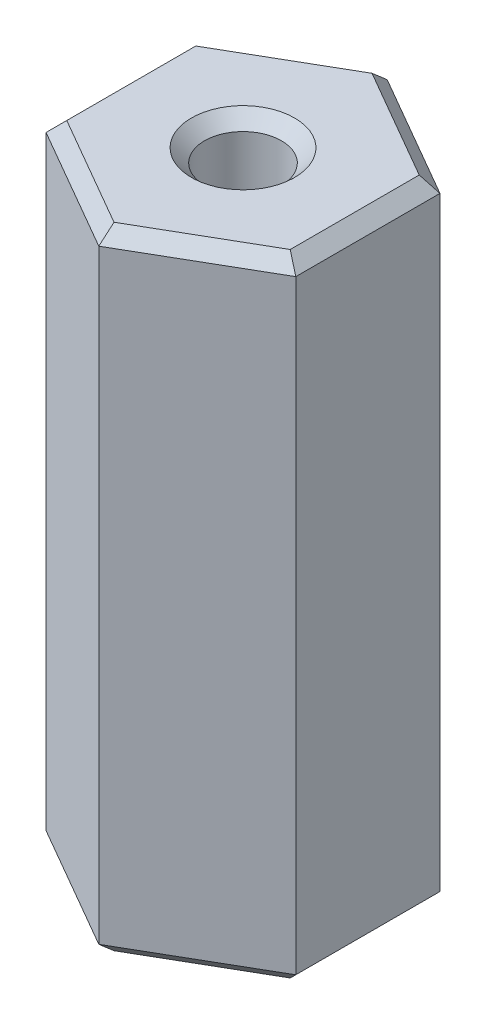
from build123d import *

# Parameters (mm, degrees)
ENL_V_MAT_EXTRU_1_DEPTH      = 52.362547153
ENL_V_MAT_EXTRU_1_DEPTH_BACK = 52.362547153
ESQUISSE2_OUTSIDE_W          = 39.918
ESQUISSE2_OUTSIDE_H          = 39.918
CHANFREIN1_SIZE              = 1


with BuildPart() as part:
    # Esquisse1 → R_volution1 (revolve)
    with BuildSketch(Plane.XY, mode=Mode.PRIVATE) as r_volution1_sk:
        Polygon((-12.925, 0), (-2.925, 0), (-2.925, 20), (0, 22.925), (0, 25.075), (-2.925, 28), (-2.925, 48), (-12.925, 48), align=None)
    revolve(r_volution1_sk.sketch.rotate(Axis((0, 0, 0), (0, 1, 0)), 270), axis=Axis((0, 0, 0), (0, 1, 0)))

    # Esquisse2 outside → Enl_v. mat.-Extru.1 (cut, two sides: drawn at the far end of the back side and taken through both)
    with BuildSketch(Plane(origin=(0, 48, 0), x_dir=(1, 0, 0), z_dir=(0, 1, 0)).offset(-ENL_V_MAT_EXTRU_1_DEPTH_BACK)):
        Rectangle(ESQUISSE2_OUTSIDE_W, ESQUISSE2_OUTSIDE_H)
        Polygon((0, 10.969655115), (-9.5, 5.484827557), (-9.5, -5.484827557), (0, -10.969655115), (9.5, -5.484827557), (9.5, 5.484827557), align=None, mode=Mode.SUBTRACT)
    extrude(amount=ENL_V_MAT_EXTRU_1_DEPTH + ENL_V_MAT_EXTRU_1_DEPTH_BACK, mode=Mode.SUBTRACT)

    # Chanfrein1
    chanfrein1_edges = [part.edges().sort_by_distance(p)[0] for p in [
        (-4.75, 48, -8.227241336),
        (-9.5, 48, 0),
        (-4.75, 48, 8.227241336),
        (4.75, 48, 8.227241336),
        (9.5, 48, 0),
        (4.75, 48, -8.227241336),
        (9.5, 0, 0),
        (4.75, 0, -8.227241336),
        (-4.75, 0, -8.227241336),
        (-9.5, 0, 0),
        (-4.75, 0, 8.227241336),
        (4.75, 0, 8.227241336),
        (0, 48, 2.925),
        (0, 0, 2.925),
    ]]
    chamfer(chanfrein1_edges, length=CHANFREIN1_SIZE)


solid = part.part
